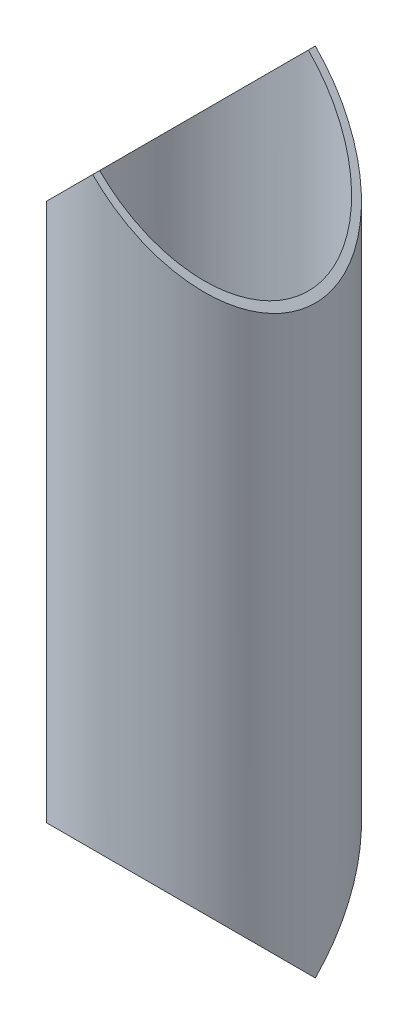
from build123d import *

# Parameters (mm, degrees)
SKETCH1_R               = 25.4
SKETCH1_R_2             = 23.8125
BOSS_EXTRUDE1_DEPTH     = 158.75
CUT_EXTRUDE1_DEPTH      = 163.763271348
CUT_EXTRUDE1_DEPTH_BACK = 163.763271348
CUT_EXTRUDE2_DEPTH      = 163.763271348
CUT_EXTRUDE2_DEPTH_BACK = 163.763271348


with BuildPart() as part:
    # Sketch1 → Boss-Extrude1 (new body)
    with BuildSketch(Plane(origin=(0, 0, 0), x_dir=(1, 0, 0), z_dir=(0, 1, 0))):
        with Locations(Location((0, 0, 0), (0, 0, 90))):
            Circle(SKETCH1_R)
        with Locations(Location((0, 0, 0), (0, 0, 90))):
            Circle(SKETCH1_R_2, mode=Mode.SUBTRACT)
    extrude(amount=BOSS_EXTRUDE1_DEPTH)

    # Sketch2 → Cut-Extrude1 (cut, two sides: drawn at the far end of the back side and taken through both)
    with BuildSketch(Plane.XY.offset(-CUT_EXTRUDE1_DEPTH_BACK)):
        Polygon((25.4, 133.35), (25.4, 158.75), (-0.960093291, 166.540490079), (-25.4, 158.75), (-25.4, 133.35), (0, 158.75), align=None)
    extrude(amount=CUT_EXTRUDE1_DEPTH + CUT_EXTRUDE1_DEPTH_BACK, mode=Mode.SUBTRACT)

    # Sketch3 → Cut-Extrude2 (cut, two sides: drawn at the far end of the back side and taken through both)
    with BuildSketch(Plane(origin=(0, 0, 0), x_dir=(0, 0, -1), z_dir=(1, 0, 0)).offset(-CUT_EXTRUDE2_DEPTH_BACK)):
        Polygon((-25.4, 25.4), (-25.4, 0), (0.032632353, -12.112837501), (25.4, 0), (25.4, 25.4), (0, 0), align=None)
    extrude(amount=CUT_EXTRUDE2_DEPTH + CUT_EXTRUDE2_DEPTH_BACK, mode=Mode.SUBTRACT)


solid = part.part
